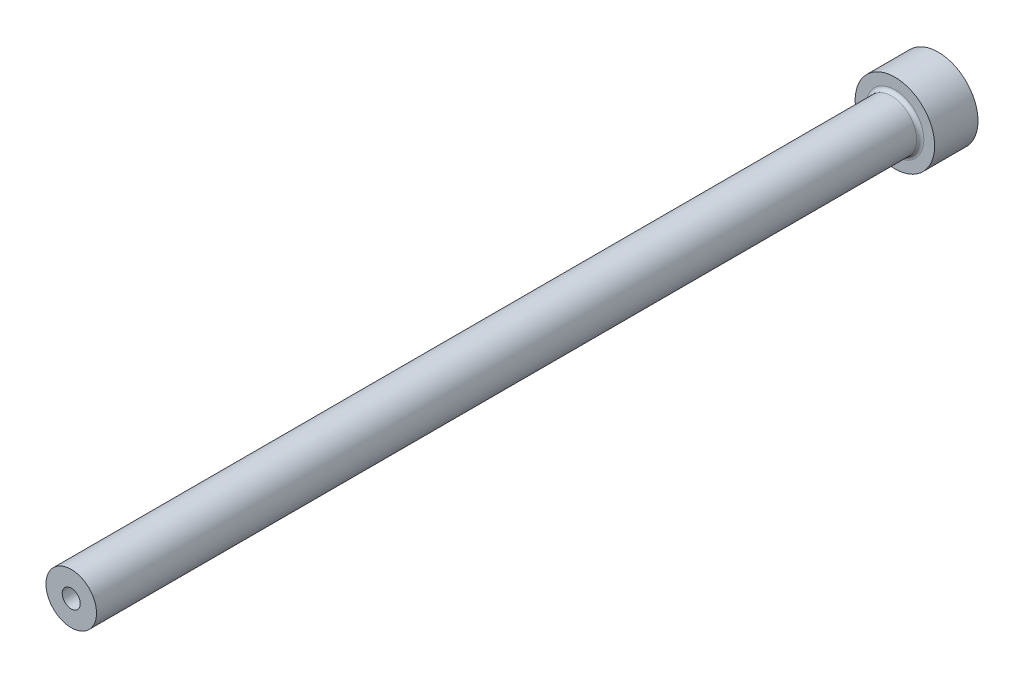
from build123d import *

# Parameters (mm, degrees)
HEAD_FILLET_R          = 0.5
ID_RELIEF_CHAMFER_SIZE = 0.5


with BuildPart() as part:
    # OD FV → Base Revolve (revolve)
    with BuildSketch(Plane(origin=(0, 0, 0), x_dir=(1, 0, 0), z_dir=(0, 1, 0))):
        Polygon((0, -120), (3.5, -120), (3.5, -6), (5.5, -6), (5.5, 0), (0, 0), align=None)
    revolve(axis=Axis((0, 0, 120), (0, 0, -1)))

    # ID FV → Hole (revolve, cut)
    with BuildSketch(Plane(origin=(0, 0, 0), x_dir=(1, 0, 0), z_dir=(0, 1, 0))):
        Polygon((0, -120), (1.25, -120), (1.25, -70), (1.5, -69.566987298), (1.5, 0), (0, 0), align=None)
    revolve(axis=Axis((0, 0, 120), (0, 0, -1)), mode=Mode.SUBTRACT)

    # Head Fillet
    head_fillet_edges = [part.edges().sort_by_distance(p)[0] for p in [
        (-3.5, 0, 6),
    ]]
    fillet(head_fillet_edges, radius=HEAD_FILLET_R)

    # ID Relief Chamfer
    id_relief_chamfer_edges = [part.edges().sort_by_distance(p)[0] for p in [
        (-1.5, 0, 0),
    ]]
    chamfer(id_relief_chamfer_edges, length=ID_RELIEF_CHAMFER_SIZE)


solid = part.part
